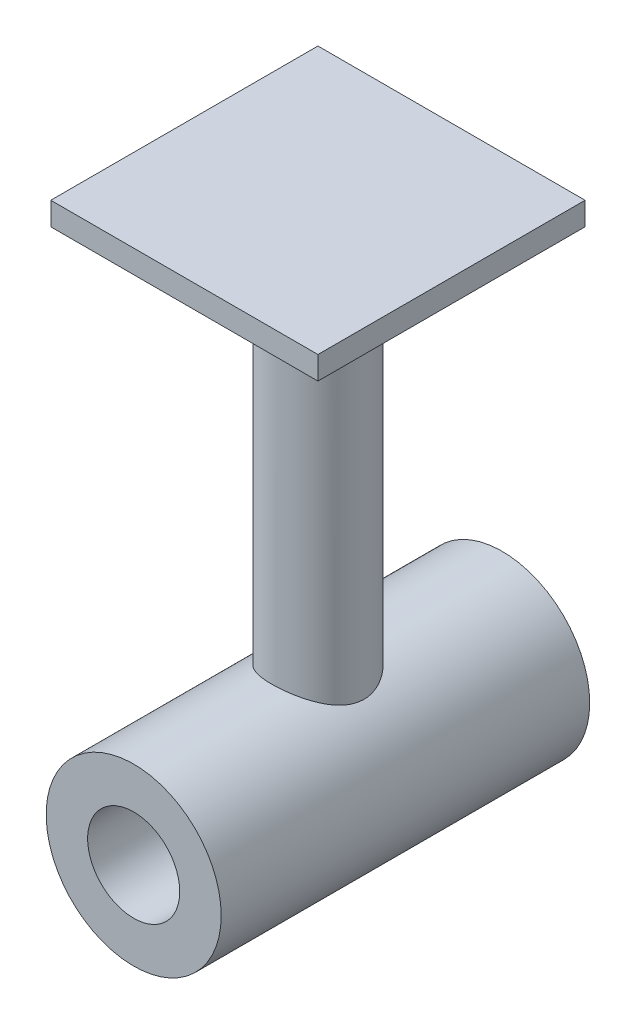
from build123d import *

# Parameters (mm, degrees)
EXTRUSION1_DEPTH      = 40
EXTRUSION1_DEPTH_BACK = 40
ESQUISSE1_R           = 19
ESQUISSE1_R_2         = 10
ESQUISSE2_R           = 10
EXTRUSION2_DEPTH      = 100
ESQUISSE3_W           = 58
ESQUISSE3_H           = 58
EXTRUSION3_DEPTH      = 5


with BuildPart() as part:
    # Esquisse1 → Extrusion1 (new, two sides: drawn at the far end of the back side and taken through both)
    with BuildSketch(Plane.XY.offset(-EXTRUSION1_DEPTH_BACK)):
        Circle(ESQUISSE1_R)
        Circle(ESQUISSE1_R_2, mode=Mode.SUBTRACT)
    extrude(amount=EXTRUSION1_DEPTH + EXTRUSION1_DEPTH_BACK)

    # Esquisse2 → Extrusion2 (add)
    with BuildSketch(Plane(origin=(0, 0, 0), x_dir=(1, 0, 0), z_dir=(0, 1, 0))):
        with Locations(Location((0, 0, 0), (0, 0, 90))):
            Circle(ESQUISSE2_R)
    extrude(amount=EXTRUSION2_DEPTH)

    # Esquisse3 → Extrusion3 (add)
    with BuildSketch(Plane(origin=(0, 100, 0), x_dir=(-1, 0, 0), z_dir=(0, 1, 0))):
        Rectangle(ESQUISSE3_W, ESQUISSE3_H)
    extrude(amount=EXTRUSION3_DEPTH)


solid = part.part
